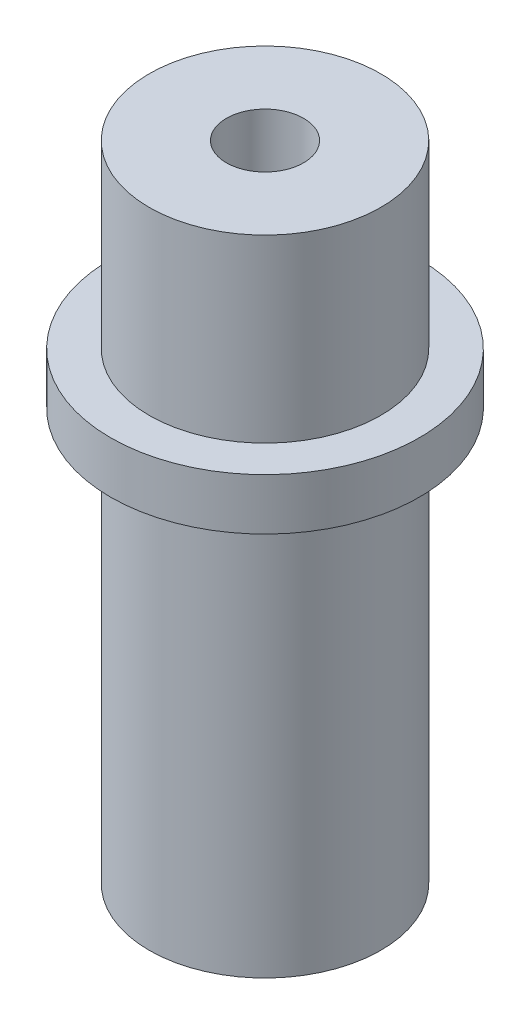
from build123d import *

# Parameters (mm, degrees)
SKETCH1_R           = 5.625
BOSS_EXTRUDE1_DEPTH = 31.25
SKETCH2_R           = 1.875
CUT_EXTRUDE1_DEPTH  = 21.75
SKETCH3_R           = 1.25
CUT_EXTRUDE2_DEPTH  = 9.5
SKETCH4_R           = 7.5
SKETCH4_R_2         = 5.625
BOSS_EXTRUDE2_DEPTH = 2.5


with BuildPart() as part:
    # Sketch1 → Boss-Extrude1 (new body)
    with BuildSketch(Plane(origin=(0, 0, 0), x_dir=(1, 0, 0), z_dir=(0, 1, 0))):
        with Locations(Location((0, 0, 0), (0, 0, 270))):
            Circle(SKETCH1_R)
    extrude(amount=BOSS_EXTRUDE1_DEPTH)

    # Sketch2 → Cut-Extrude1 (cut)
    with BuildSketch(Plane(origin=(0, 31.25, 0), x_dir=(1, 0, 0), z_dir=(0, 1, 0))):
        with Locations(Location((0, 0, 0), (0, 0, 270))):
            Circle(SKETCH2_R)
    extrude(amount=-CUT_EXTRUDE1_DEPTH, mode=Mode.SUBTRACT)

    # Sketch3 → Cut-Extrude2 (cut)
    with BuildSketch(Plane.XZ):
        with Locations(Location((0, 0, 0), (0, 0, 270))):
            Circle(SKETCH3_R)
    extrude(amount=-CUT_EXTRUDE2_DEPTH, mode=Mode.SUBTRACT)

    # Sketch4 → Boss-Extrude2 (add)
    with BuildSketch(Plane(origin=(0, 20, 0), x_dir=(1, 0, 0), z_dir=(0, 1, 0))):
        with Locations(Location((0, 0, 0), (0, 0, 270))):
            Circle(SKETCH4_R)
        with Locations(Location((0, 0, 0), (0, 0, 270))):
            Circle(SKETCH4_R_2, mode=Mode.SUBTRACT)
    extrude(amount=BOSS_EXTRUDE2_DEPTH)


solid = part.part
